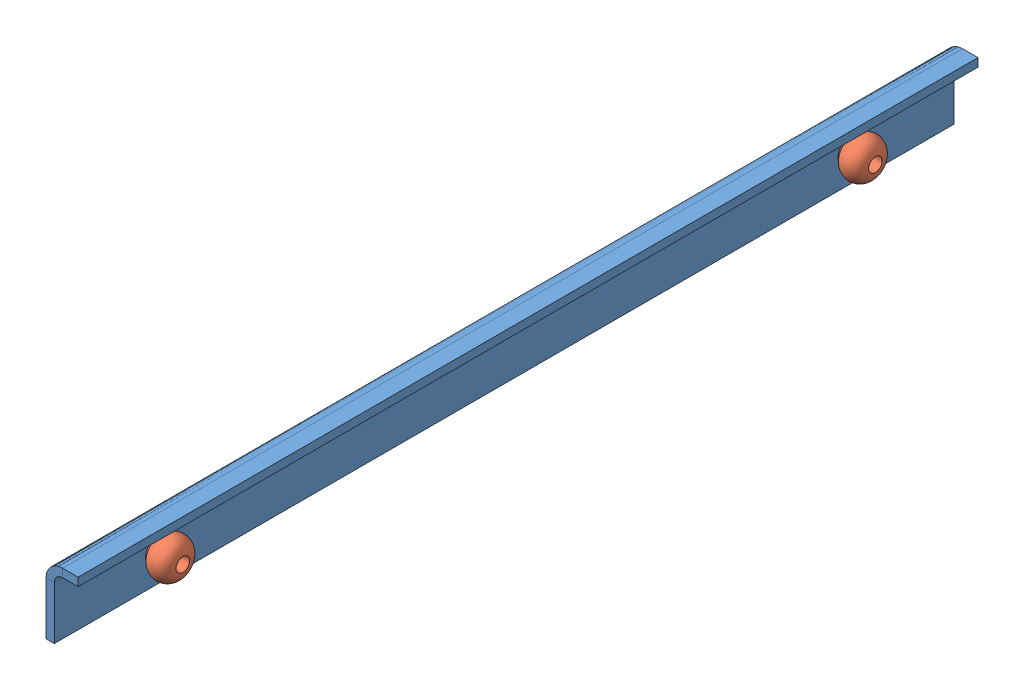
SolidWorks assembly S100104.SLDASM, configuration Výchozí (file format 5000). Lengths in mm.
Overall size (8 16.76 217).
3 component instances, 2 part files, 4 mates.
Components (placement in the parent):
- 100103-1: 100103.SLDPRT [Výchozí] at origin size (7.75 16.76 217)
- Rivet nut M4 T2-1: Rivet nut M4 T2.SLDPRT [Výchozí] at (-7.75 -7.7575 25) x (0 0.999964 -0.008442) z (-1 0 0) size (9.33 9.33 8)
- Rivet nut M4 T2-2: Rivet nut M4 T2.SLDPRT [Výchozí] at (-7.75 -7.7575 192) x (0 0.999251 0.038702) z (-1 0 0) size (9.33 9.33 8)
Mates (geometry in assembly coordinates):
- Sjednocená1: coincident aligned: plane of 100103-1 through (-7.75 -14.7575 217) normal (-1 0 0); plane of Rivet nut M4 T2-1 through (-7.75 -7.7744 23.0001) normal (-1 0 0)
- Sjednocená2: coincident aligned: plane of 100103-1 through (-7.75 -14.7575 217) normal (-1 0 0); plane of Rivet nut M4 T2-2 through (-7.75 -7.6801 190.0015) normal (-1 0 0)
- Soustředná1: concentric aligned: circle of 100103-1; cylinder of Rivet nut M4 T2-1 through (-7.75 -7.7575 25) axis (-1 0 0) radius 2
- Soustředná2: concentric aligned: circle of 100103-1; cylinder of Rivet nut M4 T2-2 through (-7.75 -7.7575 192) axis (-1 0 0) radius 2
